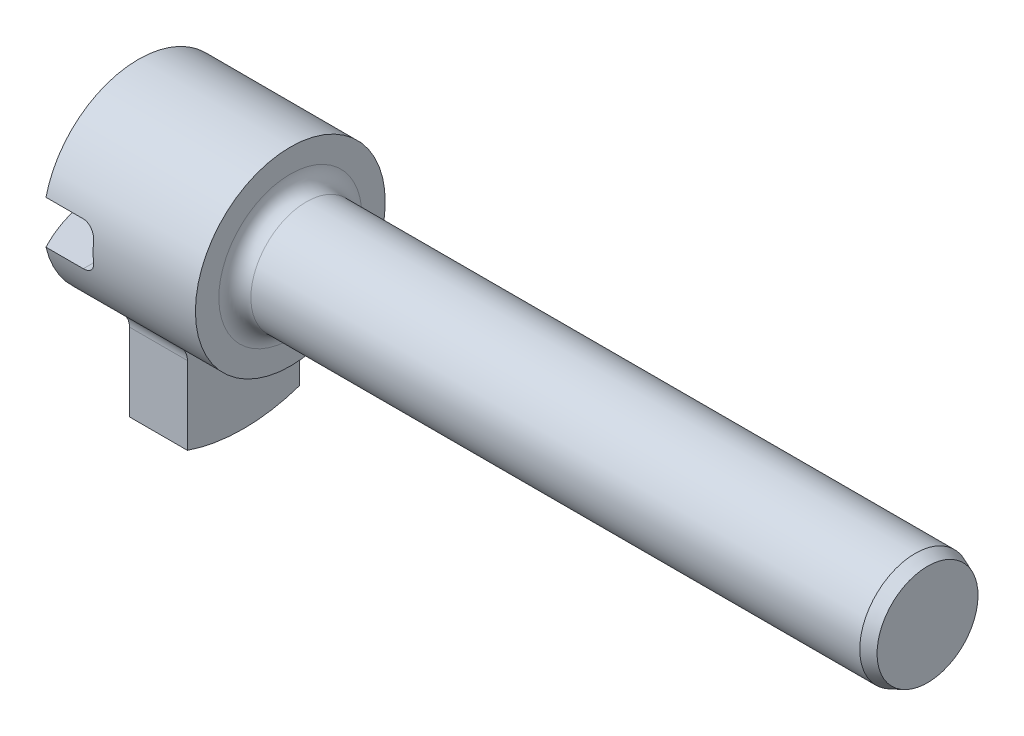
from build123d import *

# Parameters (mm, degrees)
CUT_EXTRUDE1_DEPTH      = 10
CUT_EXTRUDE1_DEPTH_BACK = 10
SKETCH2_W               = 1.4995632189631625
SKETCH2_H               = 0.8900000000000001
BOSS_EXTRUDE1_DEPTH     = 1.1938
FILLET1_R               = 0.254
FILLET2_R               = 0.381
CHAMFER1_SIZE           = 0.254
CHAMFER1_SIZE2          = 0.1026226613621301
FILLET3_R               = 0.3302


with BuildPart() as part:
    # Sketch1 → Revolve1 (revolve)
    with BuildSketch(Plane.XY):
        with BuildLine():
            Line((0, 0), (-15.240000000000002, -1.84e-15))
            Line((-15.240000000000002, -1.84e-15), (-15.240000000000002, 0.4449999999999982))
            Line((-15.240000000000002, 0.4449999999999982), (-16.739563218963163, 0.4449999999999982))
            ThreePointArc((-16.739563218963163, 0.4449999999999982), (-16.57530085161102, 1.223985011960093), (-16.26232508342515, 1.9559999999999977))
            Line((-16.26232508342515, 1.9559999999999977), (-13.132000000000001, 1.9559999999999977))
            Line((-13.132000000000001, 1.9559999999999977), (-13.132000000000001, 1.143))
            Line((-13.132000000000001, 1.143), (0, 1.143))
            Line((0, 1.143), (0, 0))
        make_face()
    revolve(axis=Axis((0, 0, 0), (-1, -1.2e-16, 0)))

    # Sketch2 → Cut-Extrude1 (cut, two sides: drawn at the far end of the back side and taken through both)
    with BuildSketch(Plane.XY.offset(-CUT_EXTRUDE1_DEPTH_BACK)):
        with Locations((-15.989781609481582, -2.08e-15)):
            Rectangle(SKETCH2_W, SKETCH2_H)
    extrude(amount=CUT_EXTRUDE1_DEPTH + CUT_EXTRUDE1_DEPTH_BACK, mode=Mode.SUBTRACT)

    # Sketch3 → Boss-Extrude1 (add)
    with BuildSketch(Plane(origin=(-14.0972, -1.7e-15, 0), x_dir=(0, 0, -1), z_dir=(1, 1.2e-16, 0))):
        with BuildLine():
            Line((-1.156, -1.577846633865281), (-1.156, -3.3628559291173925))
            ThreePointArc((-1.156, -3.3628559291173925), (2.2e-16, -3.556), (1.1559999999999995, -3.362855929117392))
            Line((1.1559999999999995, -3.362855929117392), (1.156, -1.577846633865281))
            ThreePointArc((1.156, -1.577846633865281), (-3.1e-16, -1.9559999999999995), (-1.156, -1.577846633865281))
        make_face()
    extrude(amount=-BOSS_EXTRUDE1_DEPTH)

    # Fillet1
    fillet1_edges = [part.edges().sort_by_distance(p)[0] for p in [
        (-15.240000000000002, -0.44500000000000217, 0),
        (-15.240000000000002, 0.44499999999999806, 0),
    ]]
    fillet(fillet1_edges, radius=FILLET1_R)

    # Fillet2
    fillet2_edges = [part.edges().sort_by_distance(p)[0] for p in [
        (-14.6941, -1.5778466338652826, 1.156),
        (-14.6941, -1.577846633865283, -1.1560000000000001),
    ]]
    fillet(fillet2_edges, radius=FILLET2_R)

    # Chamfer1
    chamfer1_edges = [part.edges().sort_by_distance(p)[0] for p in [
        (2.8e-16, -1.143, -1.4e-16),
    ]]
    chamfer1_side = [part.faces().sort_by_distance(p)[0] for p in [
        (-6.566000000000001, -1.1430000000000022, -1.4e-16),
    ]]
    chamfer(chamfer1_edges, length=CHAMFER1_SIZE, length2=CHAMFER1_SIZE2, reference=chamfer1_side[0])

    # Fillet3
    fillet3_edges = [part.edges().sort_by_distance(p)[0] for p in [
        (-13.132000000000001, -1.1430000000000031, -1.4e-16),
    ]]
    fillet(fillet3_edges, radius=FILLET3_R)


solid = part.part
